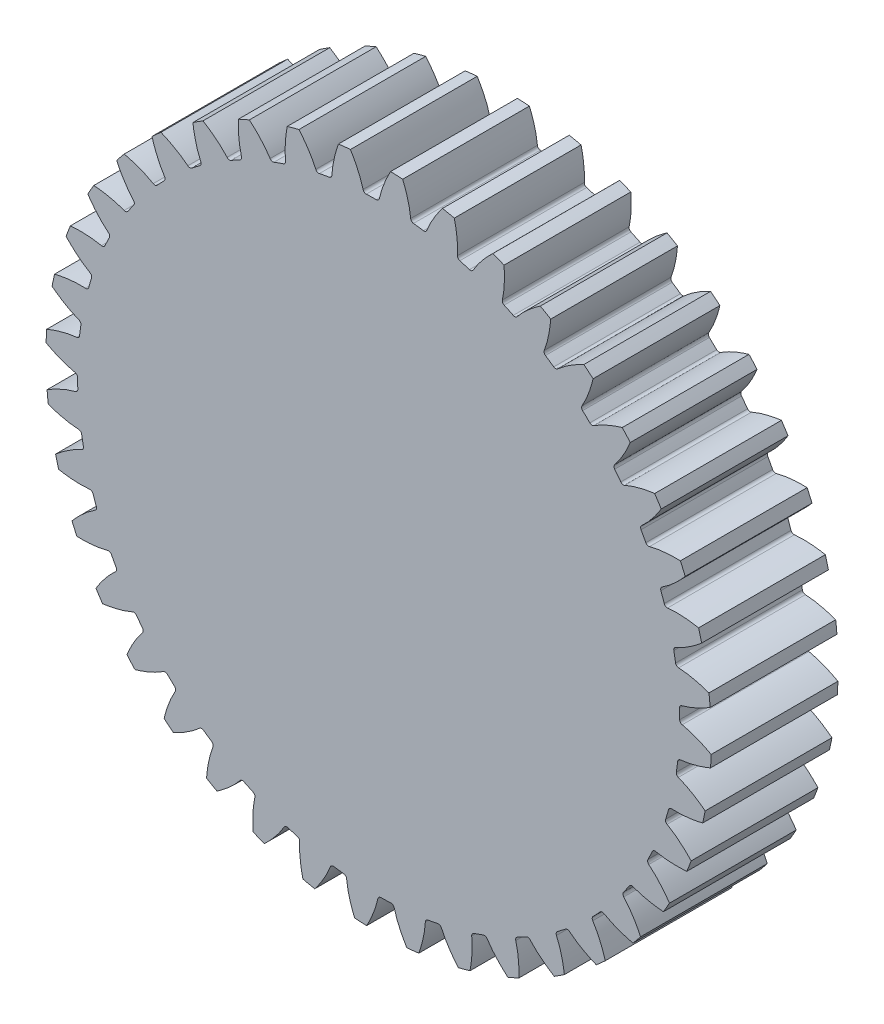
from build123d import *

# Parameters (mm, degrees)
SZKIC2_R                        = 105
DODANIE_WYCI_GNI_CIE1_DEPTH     = 40
WYTNIJ_WYCI_GNI_CIE1_DEPTH      = 154.785564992
ZAOKR_GLENIE1_R                 = 1
SZYK_KO_OWY1_COUNT              = 40
ZAOKR_GLENIE1_OF_SZYK_KO_OWY1_R = 1


with BuildPart() as part:
    # Szkic2 → Dodanie-wyci_gni_cie1 (new body)
    with BuildSketch(Plane.XY):
        Circle(SZKIC2_R)
    extrude(amount=DODANIE_WYCI_GNI_CIE1_DEPTH)

    # Szkic3 → Wytnij-wyci_gni_cie1 (cut, through all)
    with BuildSketch(Plane.XY.offset(40)):
        with BuildLine():
            ThreePointArc((0.102426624, 94.999944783), (-2.314381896, 94.971804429), (-4.72969235, 94.882190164))
            add(Edge.make_bspline(
                [(-4.72969235, 94.882190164), (-4.751126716, 94.989622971), (-4.821783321, 95.325412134), (-4.958008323, 95.888246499), (-5.212196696, 96.784170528), (-5.585760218, 97.898774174), (-6.052018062, 99.107477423), (-6.618085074, 100.402527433), (-7.23493062, 101.675639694), (-7.878846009, 102.891787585), (-8.385748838, 103.779650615), (-8.72856248, 104.353742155), (-8.892498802, 104.622767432)],
                knots=[0.020052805, 0.020052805, 0.020052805, 0.020052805, 0.020052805, 0.02853182, 0.046610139, 0.064854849, 0.092110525, 0.119476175, 0.146842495, 0.174208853, 0.201574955, 0.225957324, 0.225957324, 0.225957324, 0.225957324, 0.225957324], degree=4))
            ThreePointArc((-8.892498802, 104.622767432), (-2.558001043, 104.968836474), (3.785834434, 104.931727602))
            add(Edge.make_bspline(
                [(0.102426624, 94.999944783), (0.118602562, 95.108294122), (0.17281922, 95.447126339), (0.281467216, 96.015928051), (0.491713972, 96.923169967), (0.810542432, 98.054646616), (1.217371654, 99.284626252), (1.719685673, 100.605711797), (2.273786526, 101.907359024), (2.857699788, 103.153428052), (3.320753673, 104.0649281), (3.635196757, 104.655036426), (3.785834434, 104.931727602)],
                knots=[0.020052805, 0.020052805, 0.020052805, 0.020052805, 0.020052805, 0.02853182, 0.046610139, 0.064854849, 0.092110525, 0.119476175, 0.146842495, 0.174208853, 0.201574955, 0.225957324, 0.225957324, 0.225957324, 0.225957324, 0.225957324], degree=4))
        make_face()
    wytnij_wyci_gni_cie1 = extrude(amount=-WYTNIJ_WYCI_GNI_CIE1_DEPTH, mode=Mode.SUBTRACT)

    # Zaokr_glenie1
    zaokr_glenie1_edges = [part.edges().sort_by_distance(p)[0] for p in [
        (0.102426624, 94.999944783, 20),
        (-4.72969235, 94.882190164, 20),
    ]]
    fillet(zaokr_glenie1_edges, radius=ZAOKR_GLENIE1_R)

    # Szyk ko_owy1: Wytnij-wyci_gni_cie1 ×40 about axis
    szyk_ko_owy1_axis = Axis((0, 0, 40), (0, 0, -1))
    for i in range(1, SZYK_KO_OWY1_COUNT):
        add(wytnij_wyci_gni_cie1.rotate(szyk_ko_owy1_axis, i * 360 / SZYK_KO_OWY1_COUNT), mode=Mode.SUBTRACT)

    # Zaokr_glenie1 of Szyk ko_owy1
    zaokr_glenie1_of_szyk_ko_owy1_edges = [part.edges().sort_by_distance(p)[0] for p in [
        (14.962431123, 93.814314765, 20),
        (10.171382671, 94.453919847, 20),
        (29.454010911, 90.318664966, 20),
        (24.822004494, 91.69988055, 20),
        (43.220335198, 84.599069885, 20),
        (38.861426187, 86.687885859, 20),
        (55.922431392, 76.796364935, 20),
        (51.943950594, 79.541347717, 20),
        (67.247531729, 67.102678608, 20),
        (63.747442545, 70.436237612, 20),
        (76.916774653, 55.756701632, 20),
        (73.981260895, 59.596753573, 20),
        (84.692071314, 43.037809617, 20),
        (82.393415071, 47.28979967, 20),
        (90.381968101, 29.259183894, 20),
        (88.776769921, 33.818413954, 20),
        (93.846360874, 14.760099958, 20),
        (92.974146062, 19.514306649, 20),
        (94.999944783, -0.102426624, 20),
        (94.882190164, 4.72969235, 20),
        (93.814314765, -14.962431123, 20),
        (94.453919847, -10.171382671, 20),
        (90.318664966, -29.454010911, 20),
        (91.69988055, -24.822004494, 20),
        (84.599069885, -43.220335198, 20),
        (86.687885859, -38.861426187, 20),
        (76.796364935, -55.922431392, 20),
        (79.541347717, -51.943950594, 20),
        (67.102678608, -67.247531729, 20),
        (70.436237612, -63.747442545, 20),
        (55.756701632, -76.916774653, 20),
        (59.596753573, -73.981260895, 20),
        (43.037809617, -84.692071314, 20),
        (47.28979967, -82.393415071, 20),
        (29.259183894, -90.381968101, 20),
        (33.818413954, -88.776769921, 20),
        (14.760099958, -93.846360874, 20),
        (19.514306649, -92.974146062, 20),
        (-0.102426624, -94.999944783, 20),
        (4.72969235, -94.882190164, 20),
        (-14.962431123, -93.814314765, 20),
        (-10.171382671, -94.453919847, 20),
        (-29.454010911, -90.318664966, 20),
        (-24.822004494, -91.69988055, 20),
        (-43.220335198, -84.599069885, 20),
        (-38.861426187, -86.687885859, 20),
        (-55.922431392, -76.796364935, 20),
        (-51.943950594, -79.541347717, 20),
        (-67.247531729, -67.102678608, 20),
        (-63.747442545, -70.436237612, 20),
        (-76.916774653, -55.756701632, 20),
        (-73.981260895, -59.596753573, 20),
        (-84.692071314, -43.037809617, 20),
        (-82.393415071, -47.28979967, 20),
        (-90.381968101, -29.259183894, 20),
        (-88.776769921, -33.818413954, 20),
        (-93.846360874, -14.760099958, 20),
        (-92.974146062, -19.514306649, 20),
        (-94.999944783, 0.102426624, 20),
        (-94.882190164, -4.72969235, 20),
        (-93.814314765, 14.962431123, 20),
        (-94.453919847, 10.171382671, 20),
        (-90.318664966, 29.454010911, 20),
        (-91.69988055, 24.822004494, 20),
        (-84.599069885, 43.220335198, 20),
        (-86.687885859, 38.861426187, 20),
        (-76.796364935, 55.922431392, 20),
        (-79.541347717, 51.943950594, 20),
        (-67.102678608, 67.247531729, 20),
        (-70.436237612, 63.747442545, 20),
        (-55.756701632, 76.916774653, 20),
        (-59.596753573, 73.981260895, 20),
        (-43.037809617, 84.692071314, 20),
        (-47.28979967, 82.393415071, 20),
        (-29.259183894, 90.381968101, 20),
        (-33.818413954, 88.776769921, 20),
        (-14.760099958, 93.846360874, 20),
        (-19.514306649, 92.974146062, 20),
    ]]
    fillet(zaokr_glenie1_of_szyk_ko_owy1_edges, radius=ZAOKR_GLENIE1_OF_SZYK_KO_OWY1_R)


solid = part.part
